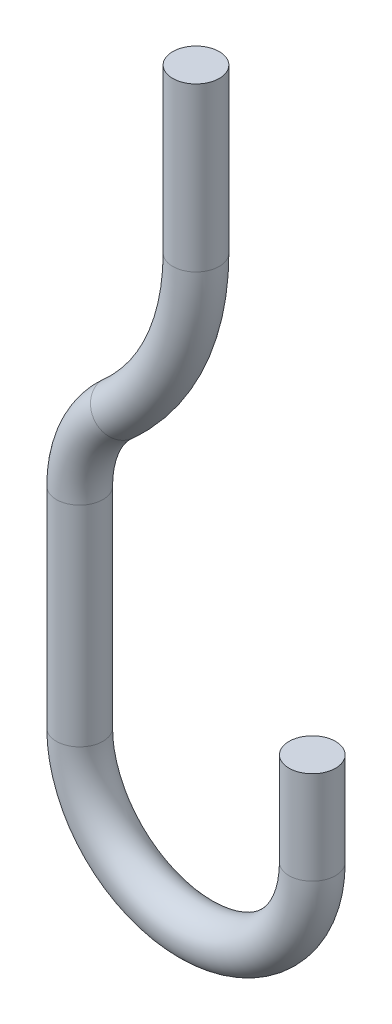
ISO-10303-21;
HEADER;
FILE_DESCRIPTION(('STEP AP214'),'2;1');
FILE_NAME('part.step','',(''),(''),'','','');
FILE_SCHEMA(('AUTOMOTIVE_DESIGN { 1 0 10303 214 1 1 1 1 }'));
ENDSEC;
DATA;
#1=APPLICATION_CONTEXT('core data for automotive mechanical design processes');
#2=APPLICATION_PROTOCOL_DEFINITION('international standard','automotive_design',2000,#1);
#3=PRODUCT_CONTEXT('',#1,'mechanical');
#4=PRODUCT('Part','Part','',(#3));
#5=PRODUCT_RELATED_PRODUCT_CATEGORY('part','',(#4));
#6=PRODUCT_DEFINITION_FORMATION('','',#4);
#7=PRODUCT_DEFINITION_CONTEXT('part definition',#1,'design');
#8=PRODUCT_DEFINITION('design','',#6,#7);
#9=PRODUCT_DEFINITION_SHAPE('','',#8);
#10=(LENGTH_UNIT() NAMED_UNIT(*) SI_UNIT(.MILLI.,.METRE.));
#11=(NAMED_UNIT(*) PLANE_ANGLE_UNIT() SI_UNIT($,.RADIAN.));
#12=(NAMED_UNIT(*) SI_UNIT($,.STERADIAN.) SOLID_ANGLE_UNIT());
#13=UNCERTAINTY_MEASURE_WITH_UNIT(LENGTH_MEASURE(1.E-05),#10,'distance_accuracy_value','');
#14=(GEOMETRIC_REPRESENTATION_CONTEXT(3) GLOBAL_UNCERTAINTY_ASSIGNED_CONTEXT((#13)) GLOBAL_UNIT_ASSIGNED_CONTEXT((#10,
#11,#12)) REPRESENTATION_CONTEXT('',''));
#15=CARTESIAN_POINT('',(0.,0.,0.));
#16=DIRECTION('',(0.,0.,1.));
#17=DIRECTION('',(1.,0.,0.));
#18=AXIS2_PLACEMENT_3D('',#15,#16,#17);
#19=CARTESIAN_POINT('',(25.,-135.901699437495,0.));
#20=DIRECTION('',(0.,1.,0.));
#21=DIRECTION('',(-1.,0.,0.));
#22=AXIS2_PLACEMENT_3D('',#19,#20,#21);
#23=CYLINDRICAL_SURFACE('',#22,5.);
#24=CARTESIAN_POINT('',(25.,-135.901699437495,0.));
#25=DIRECTION('',(0.,-1.,0.));
#26=DIRECTION('',(0.,0.,1.));
#27=AXIS2_PLACEMENT_3D('',#24,#25,#26);
#28=CIRCLE('',#27,5.);
#29=CARTESIAN_POINT('',(30.,-135.901699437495,0.));
#30=VERTEX_POINT('',#29);
#31=EDGE_CURVE('E36',#30,#30,#28,.T.);
#32=ORIENTED_EDGE('',*,*,#31,.F.);
#33=EDGE_LOOP('',(#32));
#34=FACE_BOUND('',#33,.T.);
#35=CARTESIAN_POINT('',(25.,-115.901699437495,0.));
#36=DIRECTION('',(0.,-1.,0.));
#37=DIRECTION('',(0.,0.,1.));
#38=AXIS2_PLACEMENT_3D('',#35,#36,#37);
#39=CIRCLE('',#38,5.);
#40=CARTESIAN_POINT('',(25.,-115.901699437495,5.));
#41=VERTEX_POINT('',#40);
#42=EDGE_CURVE('E10',#41,#41,#39,.T.);
#43=ORIENTED_EDGE('',*,*,#42,.T.);
#44=EDGE_LOOP('',(#43));
#45=FACE_BOUND('',#44,.T.);
#46=ADVANCED_FACE('F30',(#34,#45),#23,.T.);
#47=CARTESIAN_POINT('',(0.,-135.901699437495,0.));
#48=DIRECTION('',(0.,0.,1.));
#49=DIRECTION('',(1.,0.,0.));
#50=AXIS2_PLACEMENT_3D('',#47,#48,#49);
#51=TOROIDAL_SURFACE('',#50,25.,5.);
#52=CARTESIAN_POINT('',(-25.,-135.901699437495,0.));
#53=DIRECTION('',(0.,1.,0.));
#54=DIRECTION('',(0.,0.,1.));
#55=AXIS2_PLACEMENT_3D('',#52,#53,#54);
#56=CIRCLE('',#55,5.);
#57=CARTESIAN_POINT('',(-30.,-135.901699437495,0.));
#58=VERTEX_POINT('',#57);
#59=EDGE_CURVE('E40',#58,#58,#56,.T.);
#60=CARTESIAN_POINT('',(0.,-135.901699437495,0.));
#61=DIRECTION('',(0.,0.,1.));
#62=DIRECTION('',(1.,0.,0.));
#63=AXIS2_PLACEMENT_3D('',#60,#61,#62);
#64=CIRCLE('',#63,30.);
#65=EDGE_CURVE('',#58,#30,#64,.T.);
#66=ORIENTED_EDGE('',*,*,#59,.F.);
#67=ORIENTED_EDGE('',*,*,#31,.T.);
#68=ORIENTED_EDGE('',*,*,#65,.T.);
#69=ORIENTED_EDGE('',*,*,#65,.F.);
#70=EDGE_LOOP('',(#66,#68,#67,#69));
#71=FACE_BOUND('',#70,.T.);
#72=ADVANCED_FACE('F77',(#71),#51,.T.);
#73=CARTESIAN_POINT('',(-25.,-90.9016994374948,0.));
#74=DIRECTION('',(0.,-1.,0.));
#75=DIRECTION('',(0.,0.,-1.));
#76=AXIS2_PLACEMENT_3D('',#73,#74,#75);
#77=CYLINDRICAL_SURFACE('',#76,5.);
#78=CARTESIAN_POINT('',(-25.,-90.9016994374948,0.));
#79=DIRECTION('',(0.,1.,0.));
#80=DIRECTION('',(0.,0.,1.));
#81=AXIS2_PLACEMENT_3D('',#78,#79,#80);
#82=CIRCLE('',#81,5.);
#83=CARTESIAN_POINT('',(-30.,-90.9016994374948,0.));
#84=VERTEX_POINT('',#83);
#85=EDGE_CURVE('E44',#84,#84,#82,.T.);
#86=ORIENTED_EDGE('',*,*,#85,.F.);
#87=EDGE_LOOP('',(#86));
#88=FACE_BOUND('',#87,.T.);
#89=ORIENTED_EDGE('',*,*,#59,.T.);
#90=EDGE_LOOP('',(#89));
#91=FACE_BOUND('',#90,.T.);
#92=ADVANCED_FACE('F71',(#88,#91),#77,.T.);
#93=CARTESIAN_POINT('',(0.,-90.9016994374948,0.));
#94=DIRECTION('',(0.,0.,1.));
#95=DIRECTION('',(1.,0.,0.));
#96=AXIS2_PLACEMENT_3D('',#93,#94,#95);
#97=TOROIDAL_SURFACE('',#96,25.,5.);
#98=CARTESIAN_POINT('',(-16.6666666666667,-72.2677996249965,0.));
#99=DIRECTION('',(0.74535599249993,0.666666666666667,0.));
#100=DIRECTION('',(0.,0.,1.));
#101=AXIS2_PLACEMENT_3D('',#98,#99,#100);
#102=CIRCLE('',#101,5.);
#103=CARTESIAN_POINT('',(-20.,-68.5410196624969,0.));
#104=VERTEX_POINT('',#103);
#105=EDGE_CURVE('E49',#104,#104,#102,.T.);
#106=CARTESIAN_POINT('',(0.,-90.9016994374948,0.));
#107=DIRECTION('',(0.,0.,1.));
#108=DIRECTION('',(1.,0.,0.));
#109=AXIS2_PLACEMENT_3D('',#106,#107,#108);
#110=CIRCLE('',#109,30.);
#111=EDGE_CURVE('',#104,#84,#110,.T.);
#112=ORIENTED_EDGE('',*,*,#105,.F.);
#113=ORIENTED_EDGE('',*,*,#85,.T.);
#114=ORIENTED_EDGE('',*,*,#111,.T.);
#115=ORIENTED_EDGE('',*,*,#111,.F.);
#116=EDGE_LOOP('',(#112,#114,#113,#115));
#117=FACE_BOUND('',#116,.T.);
#118=ADVANCED_FACE('F65',(#117),#97,.T.);
#119=CARTESIAN_POINT('',(-50.,-35.,0.));
#120=DIRECTION('',(0.,0.,-1.));
#121=DIRECTION('',(-1.,0.,0.));
#122=AXIS2_PLACEMENT_3D('',#119,#120,#121);
#123=TOROIDAL_SURFACE('',#122,50.,5.);
#124=CARTESIAN_POINT('',(0.,-35.,0.));
#125=DIRECTION('',(0.,1.,0.));
#126=DIRECTION('',(0.,0.,1.));
#127=AXIS2_PLACEMENT_3D('',#124,#125,#126);
#128=CIRCLE('',#127,5.);
#129=CARTESIAN_POINT('',(0.,-35.,5.));
#130=VERTEX_POINT('',#129);
#131=EDGE_CURVE('E52',#130,#130,#128,.T.);
#132=ORIENTED_EDGE('',*,*,#131,.F.);
#133=EDGE_LOOP('',(#132));
#134=FACE_BOUND('',#133,.T.);
#135=ORIENTED_EDGE('',*,*,#105,.T.);
#136=EDGE_LOOP('',(#135));
#137=FACE_BOUND('',#136,.T.);
#138=ADVANCED_FACE('F62',(#134,#137),#123,.T.);
#139=CARTESIAN_POINT('',(0.,-35.,0.));
#140=DIRECTION('',(0.,1.,0.));
#141=DIRECTION('',(-1.,0.,0.));
#142=AXIS2_PLACEMENT_3D('',#139,#140,#141);
#143=CYLINDRICAL_SURFACE('',#142,5.);
#144=ORIENTED_EDGE('',*,*,#131,.T.);
#145=EDGE_LOOP('',(#144));
#146=FACE_BOUND('',#145,.T.);
#147=CARTESIAN_POINT('',(0.,0.,0.));
#148=DIRECTION('',(0.,1.,0.));
#149=DIRECTION('',(0.,0.,1.));
#150=AXIS2_PLACEMENT_3D('',#147,#148,#149);
#151=CIRCLE('',#150,5.);
#152=CARTESIAN_POINT('',(0.,0.,5.));
#153=VERTEX_POINT('',#152);
#154=EDGE_CURVE('E53',#153,#153,#151,.T.);
#155=ORIENTED_EDGE('',*,*,#154,.F.);
#156=EDGE_LOOP('',(#155));
#157=FACE_BOUND('',#156,.T.);
#158=ADVANCED_FACE('F59',(#146,#157),#143,.T.);
#159=CARTESIAN_POINT('',(25.,-115.901699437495,0.));
#160=DIRECTION('',(0.,-1.,0.));
#161=DIRECTION('',(0.,0.,1.));
#162=AXIS2_PLACEMENT_3D('',#159,#160,#161);
#163=PLANE('',#162);
#164=ORIENTED_EDGE('',*,*,#42,.F.);
#165=EDGE_LOOP('',(#164));
#166=FACE_BOUND('',#165,.T.);
#167=ADVANCED_FACE('F89',(#166),#163,.F.);
#168=CARTESIAN_POINT('',(0.,0.,0.));
#169=DIRECTION('',(0.,1.,0.));
#170=DIRECTION('',(0.,0.,1.));
#171=AXIS2_PLACEMENT_3D('',#168,#169,#170);
#172=PLANE('',#171);
#173=ORIENTED_EDGE('',*,*,#154,.T.);
#174=EDGE_LOOP('',(#173));
#175=FACE_BOUND('',#174,.T.);
#176=ADVANCED_FACE('F90',(#175),#172,.T.);
#177=CLOSED_SHELL('',(#46,#72,#92,#118,#138,#158,#167,#176));
#178=MANIFOLD_SOLID_BREP('B2',#177);
#179=ADVANCED_BREP_SHAPE_REPRESENTATION('',(#18,#178),#14);
#180=SHAPE_DEFINITION_REPRESENTATION(#9,#179);
ENDSEC;
END-ISO-10303-21;
